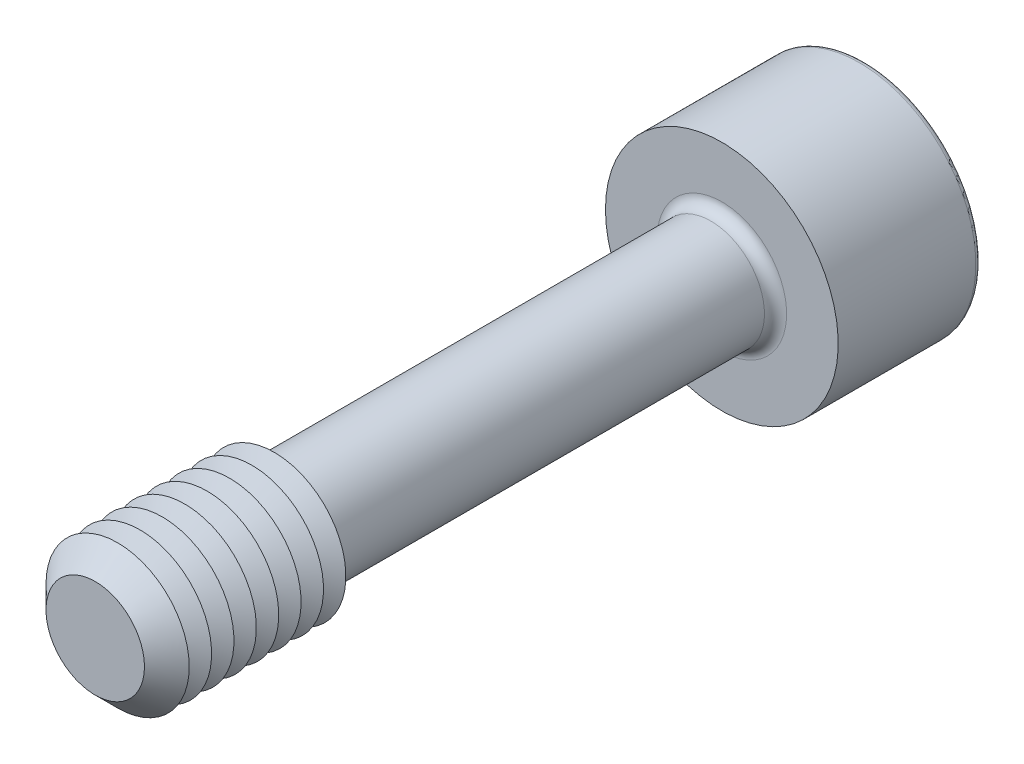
ISO-10303-21;
HEADER;
FILE_DESCRIPTION(('STEP AP214'),'2;1');
FILE_NAME('part.step','',(''),(''),'','','');
FILE_SCHEMA(('AUTOMOTIVE_DESIGN { 1 0 10303 214 1 1 1 1 }'));
ENDSEC;
DATA;
#1=APPLICATION_CONTEXT('core data for automotive mechanical design processes');
#2=APPLICATION_PROTOCOL_DEFINITION('international standard','automotive_design',2000,#1);
#3=PRODUCT_CONTEXT('',#1,'mechanical');
#4=PRODUCT('Part','Part','',(#3));
#5=PRODUCT_RELATED_PRODUCT_CATEGORY('part','',(#4));
#6=PRODUCT_DEFINITION_FORMATION('','',#4);
#7=PRODUCT_DEFINITION_CONTEXT('part definition',#1,'design');
#8=PRODUCT_DEFINITION('design','',#6,#7);
#9=PRODUCT_DEFINITION_SHAPE('','',#8);
#10=(LENGTH_UNIT() NAMED_UNIT(*) SI_UNIT(.MILLI.,.METRE.));
#11=(NAMED_UNIT(*) PLANE_ANGLE_UNIT() SI_UNIT($,.RADIAN.));
#12=(NAMED_UNIT(*) SI_UNIT($,.STERADIAN.) SOLID_ANGLE_UNIT());
#13=UNCERTAINTY_MEASURE_WITH_UNIT(LENGTH_MEASURE(1.E-05),#10,'distance_accuracy_value','');
#14=(GEOMETRIC_REPRESENTATION_CONTEXT(3) GLOBAL_UNCERTAINTY_ASSIGNED_CONTEXT((#13)) GLOBAL_UNIT_ASSIGNED_CONTEXT((#10,
#11,#12)) REPRESENTATION_CONTEXT('',''));
#15=CARTESIAN_POINT('',(0.,0.,0.));
#16=DIRECTION('',(0.,0.,1.));
#17=DIRECTION('',(1.,0.,0.));
#18=AXIS2_PLACEMENT_3D('',#15,#16,#17);
#19=CARTESIAN_POINT('',(-1.73205080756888,-3.,-19.5));
#20=DIRECTION('',(0.,0.,1.));
#21=DIRECTION('',(1.,0.,0.));
#22=AXIS2_PLACEMENT_3D('',#19,#20,#21);
#23=PLANE('',#22);
#24=DIRECTION('',(1.,0.,0.));
#25=VECTOR('',#24,1.);
#26=CARTESIAN_POINT('',(-1.73205080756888,-3.,-19.5));
#27=LINE('',#26,#25);
#28=CARTESIAN_POINT('',(0.,-3.,-19.5));
#29=VERTEX_POINT('',#28);
#30=CARTESIAN_POINT('',(1.73205080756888,-3.,-19.5));
#31=VERTEX_POINT('',#30);
#32=EDGE_CURVE('E405',#29,#31,#27,.T.);
#33=ORIENTED_EDGE('',*,*,#32,.F.);
#34=CARTESIAN_POINT('',(0.,0.,-19.5));
#35=DIRECTION('',(0.,0.,1.));
#36=DIRECTION('',(0.,-1.,0.));
#37=AXIS2_PLACEMENT_3D('',#34,#35,#36);
#38=CIRCLE('',#37,3.);
#39=CARTESIAN_POINT('',(2.59807621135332,-1.5,-19.5));
#40=VERTEX_POINT('',#39);
#41=EDGE_CURVE('E53',#29,#40,#38,.T.);
#42=ORIENTED_EDGE('',*,*,#41,.T.);
#43=DIRECTION('',(0.5,0.866025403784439,0.));
#44=VECTOR('',#43,1.);
#45=CARTESIAN_POINT('',(1.73205080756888,-3.,-19.5));
#46=LINE('',#45,#44);
#47=EDGE_CURVE('E394',#31,#40,#46,.T.);
#48=ORIENTED_EDGE('',*,*,#47,.F.);
#49=EDGE_LOOP('',(#33,#42,#48));
#50=FACE_BOUND('',#49,.T.);
#51=ADVANCED_FACE('F41',(#50),#23,.F.);
#52=CARTESIAN_POINT('',(3.46410161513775,0.,-19.5));
#53=VERTEX_POINT('',#52);
#54=EDGE_CURVE('E399',#40,#53,#46,.T.);
#55=ORIENTED_EDGE('',*,*,#54,.F.);
#56=CARTESIAN_POINT('',(2.59807621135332,1.5,-19.5));
#57=VERTEX_POINT('',#56);
#58=EDGE_CURVE('E11',#40,#57,#38,.T.);
#59=ORIENTED_EDGE('',*,*,#58,.T.);
#60=DIRECTION('',(-0.5,0.866025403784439,0.));
#61=VECTOR('',#60,1.);
#62=CARTESIAN_POINT('',(3.46410161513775,0.,-19.5));
#63=LINE('',#62,#61);
#64=EDGE_CURVE('E390',#53,#57,#63,.T.);
#65=ORIENTED_EDGE('',*,*,#64,.F.);
#66=EDGE_LOOP('',(#55,#59,#65));
#67=FACE_BOUND('',#66,.T.);
#68=ADVANCED_FACE('F133',(#67),#23,.F.);
#69=CARTESIAN_POINT('',(1.73205080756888,3.,-19.5));
#70=VERTEX_POINT('',#69);
#71=EDGE_CURVE('E389',#57,#70,#63,.T.);
#72=ORIENTED_EDGE('',*,*,#71,.F.);
#73=CARTESIAN_POINT('',(0.,3.,-19.5));
#74=VERTEX_POINT('',#73);
#75=EDGE_CURVE('E51',#57,#74,#38,.T.);
#76=ORIENTED_EDGE('',*,*,#75,.T.);
#77=DIRECTION('',(-1.,0.,0.));
#78=VECTOR('',#77,1.);
#79=CARTESIAN_POINT('',(1.73205080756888,3.,-19.5));
#80=LINE('',#79,#78);
#81=EDGE_CURVE('E177',#70,#74,#80,.T.);
#82=ORIENTED_EDGE('',*,*,#81,.F.);
#83=EDGE_LOOP('',(#72,#76,#82));
#84=FACE_BOUND('',#83,.T.);
#85=ADVANCED_FACE('F139',(#84),#23,.F.);
#86=CARTESIAN_POINT('',(-1.73205080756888,3.,-19.5));
#87=VERTEX_POINT('',#86);
#88=EDGE_CURVE('E396',#74,#87,#80,.T.);
#89=ORIENTED_EDGE('',*,*,#88,.F.);
#90=CARTESIAN_POINT('',(-2.59807621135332,1.5,-19.5));
#91=VERTEX_POINT('',#90);
#92=EDGE_CURVE('E264',#74,#91,#38,.T.);
#93=ORIENTED_EDGE('',*,*,#92,.T.);
#94=DIRECTION('',(-0.5,-0.866025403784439,0.));
#95=VECTOR('',#94,1.);
#96=CARTESIAN_POINT('',(-1.73205080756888,3.,-19.5));
#97=LINE('',#96,#95);
#98=EDGE_CURVE('E176',#87,#91,#97,.T.);
#99=ORIENTED_EDGE('',*,*,#98,.F.);
#100=EDGE_LOOP('',(#89,#93,#99));
#101=FACE_BOUND('',#100,.T.);
#102=ADVANCED_FACE('F157',(#101),#23,.F.);
#103=CARTESIAN_POINT('',(-3.46410161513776,0.,-19.5));
#104=VERTEX_POINT('',#103);
#105=EDGE_CURVE('E170',#91,#104,#97,.T.);
#106=ORIENTED_EDGE('',*,*,#105,.F.);
#107=CARTESIAN_POINT('',(-2.59807621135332,-1.5,-19.5));
#108=VERTEX_POINT('',#107);
#109=EDGE_CURVE('E172',#91,#108,#38,.T.);
#110=ORIENTED_EDGE('',*,*,#109,.T.);
#111=DIRECTION('',(0.5,-0.866025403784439,0.));
#112=VECTOR('',#111,1.);
#113=CARTESIAN_POINT('',(-3.46410161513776,0.,-19.5));
#114=LINE('',#113,#112);
#115=EDGE_CURVE('E174',#104,#108,#114,.T.);
#116=ORIENTED_EDGE('',*,*,#115,.F.);
#117=EDGE_LOOP('',(#106,#110,#116));
#118=FACE_BOUND('',#117,.T.);
#119=ADVANCED_FACE('F146',(#118),#23,.F.);
#120=CARTESIAN_POINT('',(0.,0.,-25.5));
#121=DIRECTION('',(0.,0.,-1.));
#122=DIRECTION('',(-1.,0.,0.));
#123=AXIS2_PLACEMENT_3D('',#120,#121,#122);
#124=PLANE('',#123);
#125=CARTESIAN_POINT('',(0.,0.,-25.5));
#126=DIRECTION('',(0.,0.,-1.));
#127=DIRECTION('',(-1.,0.,0.));
#128=AXIS2_PLACEMENT_3D('',#125,#126,#127);
#129=CIRCLE('',#128,6.19);
#130=CARTESIAN_POINT('',(-6.19,0.,-25.5));
#131=VERTEX_POINT('',#130);
#132=EDGE_CURVE('E250',#131,#131,#129,.T.);
#133=ORIENTED_EDGE('',*,*,#132,.T.);
#134=EDGE_LOOP('',(#133));
#135=FACE_BOUND('',#134,.T.);
#136=DIRECTION('',(-0.5,-0.866025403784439,0.));
#137=VECTOR('',#136,1.);
#138=CARTESIAN_POINT('',(-1.73205080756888,3.,-25.5));
#139=LINE('',#138,#137);
#140=CARTESIAN_POINT('',(-1.73205080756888,3.,-25.5));
#141=VERTEX_POINT('',#140);
#142=CARTESIAN_POINT('',(-3.46410161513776,0.,-25.5));
#143=VERTEX_POINT('',#142);
#144=EDGE_CURVE('E212',#141,#143,#139,.T.);
#145=ORIENTED_EDGE('',*,*,#144,.T.);
#146=DIRECTION('',(0.5,-0.866025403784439,0.));
#147=VECTOR('',#146,1.);
#148=CARTESIAN_POINT('',(-3.46410161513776,0.,-25.5));
#149=LINE('',#148,#147);
#150=CARTESIAN_POINT('',(-1.73205080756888,-3.,-25.5));
#151=VERTEX_POINT('',#150);
#152=EDGE_CURVE('E67',#143,#151,#149,.T.);
#153=ORIENTED_EDGE('',*,*,#152,.T.);
#154=DIRECTION('',(1.,0.,0.));
#155=VECTOR('',#154,1.);
#156=CARTESIAN_POINT('',(-1.73205080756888,-3.,-25.5));
#157=LINE('',#156,#155);
#158=CARTESIAN_POINT('',(1.73205080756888,-3.,-25.5));
#159=VERTEX_POINT('',#158);
#160=EDGE_CURVE('E196',#151,#159,#157,.T.);
#161=ORIENTED_EDGE('',*,*,#160,.T.);
#162=DIRECTION('',(0.5,0.866025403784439,0.));
#163=VECTOR('',#162,1.);
#164=CARTESIAN_POINT('',(1.73205080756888,-3.,-25.5));
#165=LINE('',#164,#163);
#166=CARTESIAN_POINT('',(3.46410161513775,0.,-25.5));
#167=VERTEX_POINT('',#166);
#168=EDGE_CURVE('E200',#159,#167,#165,.T.);
#169=ORIENTED_EDGE('',*,*,#168,.T.);
#170=DIRECTION('',(-0.5,0.866025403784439,0.));
#171=VECTOR('',#170,1.);
#172=CARTESIAN_POINT('',(3.46410161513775,0.,-25.5));
#173=LINE('',#172,#171);
#174=CARTESIAN_POINT('',(1.73205080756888,3.,-25.5));
#175=VERTEX_POINT('',#174);
#176=EDGE_CURVE('E204',#167,#175,#173,.T.);
#177=ORIENTED_EDGE('',*,*,#176,.T.);
#178=DIRECTION('',(-1.,0.,0.));
#179=VECTOR('',#178,1.);
#180=CARTESIAN_POINT('',(1.73205080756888,3.,-25.5));
#181=LINE('',#180,#179);
#182=EDGE_CURVE('E208',#175,#141,#181,.T.);
#183=ORIENTED_EDGE('',*,*,#182,.T.);
#184=EDGE_LOOP('',(#145,#153,#161,#169,#177,#183));
#185=FACE_BOUND('',#184,.T.);
#186=ADVANCED_FACE('F156',(#135,#185),#124,.T.);
#187=CARTESIAN_POINT('',(0.,0.,17.5));
#188=DIRECTION('',(0.,0.,-1.));
#189=DIRECTION('',(-1.,0.,0.));
#190=AXIS2_PLACEMENT_3D('',#187,#188,#189);
#191=CYLINDRICAL_SURFACE('',#190,3.);
#192=CARTESIAN_POINT('',(0.,0.,-16.88));
#193=DIRECTION('',(0.,0.,-1.));
#194=DIRECTION('',(-1.,0.,0.));
#195=AXIS2_PLACEMENT_3D('',#192,#193,#194);
#196=CIRCLE('',#195,3.);
#197=CARTESIAN_POINT('',(-3.,0.,-16.88));
#198=VERTEX_POINT('',#197);
#199=EDGE_CURVE('E247',#198,#198,#196,.F.);
#200=ORIENTED_EDGE('',*,*,#199,.T.);
#201=EDGE_LOOP('',(#200));
#202=FACE_BOUND('',#201,.T.);
#203=CARTESIAN_POINT('',(0.,0.,6.92264973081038));
#204=DIRECTION('',(0.,0.,-1.));
#205=DIRECTION('',(0.,1.,0.));
#206=AXIS2_PLACEMENT_3D('',#203,#204,#205);
#207=CIRCLE('',#206,3.);
#208=CARTESIAN_POINT('',(0.,3.,6.92264973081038));
#209=VERTEX_POINT('',#208);
#210=EDGE_CURVE('E235',#209,#209,#207,.T.);
#211=ORIENTED_EDGE('',*,*,#210,.T.);
#212=EDGE_LOOP('',(#211));
#213=FACE_BOUND('',#212,.T.);
#214=ADVANCED_FACE('F163',(#202,#213),#191,.T.);
#215=CARTESIAN_POINT('',(0.,0.,6.92264973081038));
#216=DIRECTION('',(0.,0.,1.));
#217=DIRECTION('',(0.,-1.,0.));
#218=AXIS2_PLACEMENT_3D('',#215,#216,#217);
#219=CONICAL_SURFACE('',#218,3.,1.0471975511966);
#220=CARTESIAN_POINT('',(0.,0.,7.5));
#221=DIRECTION('',(0.,0.,-1.));
#222=DIRECTION('',(-1.,0.,0.));
#223=AXIS2_PLACEMENT_3D('',#220,#221,#222);
#224=CIRCLE('',#223,4.);
#225=CARTESIAN_POINT('',(-4.,0.,7.5));
#226=VERTEX_POINT('',#225);
#227=EDGE_CURVE('E268',#226,#226,#224,.T.);
#228=ORIENTED_EDGE('',*,*,#227,.T.);
#229=EDGE_LOOP('',(#228));
#230=FACE_BOUND('',#229,.T.);
#231=ORIENTED_EDGE('',*,*,#210,.F.);
#232=EDGE_LOOP('',(#231));
#233=FACE_BOUND('',#232,.T.);
#234=ADVANCED_FACE('F347',(#230,#233),#219,.T.);
#235=CARTESIAN_POINT('',(0.,0.,-17.5));
#236=DIRECTION('',(0.,0.,-1.));
#237=DIRECTION('',(-1.,0.,0.));
#238=AXIS2_PLACEMENT_3D('',#235,#236,#237);
#239=PLANE('',#238);
#240=CARTESIAN_POINT('',(0.,0.,-17.5));
#241=DIRECTION('',(0.,0.,-1.));
#242=DIRECTION('',(-1.,0.,0.));
#243=AXIS2_PLACEMENT_3D('',#240,#241,#242);
#244=CIRCLE('',#243,3.62);
#245=CARTESIAN_POINT('',(-3.62,0.,-17.5));
#246=VERTEX_POINT('',#245);
#247=EDGE_CURVE('E243',#246,#246,#244,.T.);
#248=ORIENTED_EDGE('',*,*,#247,.T.);
#249=EDGE_LOOP('',(#248));
#250=FACE_BOUND('',#249,.T.);
#251=CARTESIAN_POINT('',(0.,0.,-17.5));
#252=DIRECTION('',(0.,0.,-1.));
#253=DIRECTION('',(-1.,0.,0.));
#254=AXIS2_PLACEMENT_3D('',#251,#252,#253);
#255=CIRCLE('',#254,6.5);
#256=CARTESIAN_POINT('',(-6.5,0.,-17.5));
#257=VERTEX_POINT('',#256);
#258=EDGE_CURVE('E231',#257,#257,#255,.T.);
#259=ORIENTED_EDGE('',*,*,#258,.F.);
#260=EDGE_LOOP('',(#259));
#261=FACE_BOUND('',#260,.T.);
#262=ADVANCED_FACE('F352',(#250,#261),#239,.F.);
#263=CARTESIAN_POINT('',(0.,0.,-25.5));
#264=DIRECTION('',(0.,0.,1.));
#265=DIRECTION('',(1.,0.,0.));
#266=AXIS2_PLACEMENT_3D('',#263,#264,#265);
#267=CYLINDRICAL_SURFACE('',#266,6.5);
#268=CARTESIAN_POINT('',(0.,0.,-25.19));
#269=DIRECTION('',(0.,0.,-1.));
#270=DIRECTION('',(-1.,0.,0.));
#271=AXIS2_PLACEMENT_3D('',#268,#269,#270);
#272=CIRCLE('',#271,6.5);
#273=CARTESIAN_POINT('',(-6.5,0.,-25.19));
#274=VERTEX_POINT('',#273);
#275=EDGE_CURVE('E45',#274,#274,#272,.F.);
#276=ORIENTED_EDGE('',*,*,#275,.T.);
#277=EDGE_LOOP('',(#276));
#278=FACE_BOUND('',#277,.T.);
#279=ORIENTED_EDGE('',*,*,#258,.T.);
#280=EDGE_LOOP('',(#279));
#281=FACE_BOUND('',#280,.T.);
#282=ADVANCED_FACE('F353',(#278,#281),#267,.T.);
#283=CARTESIAN_POINT('',(-3.46410161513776,0.,-19.5));
#284=DIRECTION('',(0.866025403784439,0.5,0.));
#285=DIRECTION('',(-0.5,0.866025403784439,0.));
#286=AXIS2_PLACEMENT_3D('',#283,#284,#285);
#287=PLANE('',#286);
#288=ORIENTED_EDGE('',*,*,#152,.F.);
#289=DIRECTION('',(0.,0.,-1.));
#290=VECTOR('',#289,1.);
#291=CARTESIAN_POINT('',(-3.46410161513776,0.,-19.5));
#292=LINE('',#291,#290);
#293=EDGE_CURVE('E186',#104,#143,#292,.T.);
#294=ORIENTED_EDGE('',*,*,#293,.F.);
#295=ORIENTED_EDGE('',*,*,#115,.T.);
#296=CARTESIAN_POINT('',(-1.73205080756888,-3.,-19.5));
#297=VERTEX_POINT('',#296);
#298=EDGE_CURVE('E215',#108,#297,#114,.T.);
#299=ORIENTED_EDGE('',*,*,#298,.T.);
#300=DIRECTION('',(0.,0.,-1.));
#301=VECTOR('',#300,1.);
#302=CARTESIAN_POINT('',(-1.73205080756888,-3.,-19.5));
#303=LINE('',#302,#301);
#304=EDGE_CURVE('E228',#297,#151,#303,.T.);
#305=ORIENTED_EDGE('',*,*,#304,.T.);
#306=EDGE_LOOP('',(#288,#294,#295,#299,#305));
#307=FACE_BOUND('',#306,.T.);
#308=ADVANCED_FACE('F356',(#307),#287,.T.);
#309=CARTESIAN_POINT('',(-1.73205080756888,-3.,-19.5));
#310=DIRECTION('',(0.,1.,0.));
#311=DIRECTION('',(0.,0.,1.));
#312=AXIS2_PLACEMENT_3D('',#309,#310,#311);
#313=PLANE('',#312);
#314=ORIENTED_EDGE('',*,*,#160,.F.);
#315=ORIENTED_EDGE('',*,*,#304,.F.);
#316=EDGE_CURVE('E402',#297,#29,#27,.T.);
#317=ORIENTED_EDGE('',*,*,#316,.T.);
#318=ORIENTED_EDGE('',*,*,#32,.T.);
#319=DIRECTION('',(0.,0.,-1.));
#320=VECTOR('',#319,1.);
#321=CARTESIAN_POINT('',(1.73205080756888,-3.,-19.5));
#322=LINE('',#321,#320);
#323=EDGE_CURVE('E225',#31,#159,#322,.T.);
#324=ORIENTED_EDGE('',*,*,#323,.T.);
#325=EDGE_LOOP('',(#314,#315,#317,#318,#324));
#326=FACE_BOUND('',#325,.T.);
#327=ADVANCED_FACE('F362',(#326),#313,.T.);
#328=CARTESIAN_POINT('',(1.73205080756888,-3.,-19.5));
#329=DIRECTION('',(-0.866025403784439,0.5,0.));
#330=DIRECTION('',(-0.5,-0.866025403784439,0.));
#331=AXIS2_PLACEMENT_3D('',#328,#329,#330);
#332=PLANE('',#331);
#333=ORIENTED_EDGE('',*,*,#168,.F.);
#334=ORIENTED_EDGE('',*,*,#323,.F.);
#335=ORIENTED_EDGE('',*,*,#47,.T.);
#336=ORIENTED_EDGE('',*,*,#54,.T.);
#337=DIRECTION('',(0.,0.,-1.));
#338=VECTOR('',#337,1.);
#339=CARTESIAN_POINT('',(3.46410161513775,0.,-19.5));
#340=LINE('',#339,#338);
#341=EDGE_CURVE('E222',#53,#167,#340,.T.);
#342=ORIENTED_EDGE('',*,*,#341,.T.);
#343=EDGE_LOOP('',(#333,#334,#335,#336,#342));
#344=FACE_BOUND('',#343,.T.);
#345=ADVANCED_FACE('F365',(#344),#332,.T.);
#346=CARTESIAN_POINT('',(3.46410161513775,0.,-19.5));
#347=DIRECTION('',(-0.866025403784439,-0.5,0.));
#348=DIRECTION('',(0.5,-0.866025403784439,0.));
#349=AXIS2_PLACEMENT_3D('',#346,#347,#348);
#350=PLANE('',#349);
#351=ORIENTED_EDGE('',*,*,#176,.F.);
#352=ORIENTED_EDGE('',*,*,#341,.F.);
#353=ORIENTED_EDGE('',*,*,#64,.T.);
#354=ORIENTED_EDGE('',*,*,#71,.T.);
#355=DIRECTION('',(0.,0.,-1.));
#356=VECTOR('',#355,1.);
#357=CARTESIAN_POINT('',(1.73205080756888,3.,-19.5));
#358=LINE('',#357,#356);
#359=EDGE_CURVE('E219',#70,#175,#358,.T.);
#360=ORIENTED_EDGE('',*,*,#359,.T.);
#361=EDGE_LOOP('',(#351,#352,#353,#354,#360));
#362=FACE_BOUND('',#361,.T.);
#363=ADVANCED_FACE('F369',(#362),#350,.T.);
#364=CARTESIAN_POINT('',(1.73205080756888,3.,-19.5));
#365=DIRECTION('',(0.,-1.,0.));
#366=DIRECTION('',(1.,0.,0.));
#367=AXIS2_PLACEMENT_3D('',#364,#365,#366);
#368=PLANE('',#367);
#369=ORIENTED_EDGE('',*,*,#182,.F.);
#370=ORIENTED_EDGE('',*,*,#359,.F.);
#371=ORIENTED_EDGE('',*,*,#81,.T.);
#372=ORIENTED_EDGE('',*,*,#88,.T.);
#373=DIRECTION('',(0.,0.,-1.));
#374=VECTOR('',#373,1.);
#375=CARTESIAN_POINT('',(-1.73205080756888,3.,-19.5));
#376=LINE('',#375,#374);
#377=EDGE_CURVE('E182',#87,#141,#376,.T.);
#378=ORIENTED_EDGE('',*,*,#377,.T.);
#379=EDGE_LOOP('',(#369,#370,#371,#372,#378));
#380=FACE_BOUND('',#379,.T.);
#381=ADVANCED_FACE('F152',(#380),#368,.T.);
#382=CARTESIAN_POINT('',(-1.73205080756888,3.,-19.5));
#383=DIRECTION('',(0.866025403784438,-0.5,0.));
#384=DIRECTION('',(0.5,0.866025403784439,0.));
#385=AXIS2_PLACEMENT_3D('',#382,#383,#384);
#386=PLANE('',#385);
#387=ORIENTED_EDGE('',*,*,#144,.F.);
#388=ORIENTED_EDGE('',*,*,#377,.F.);
#389=ORIENTED_EDGE('',*,*,#98,.T.);
#390=ORIENTED_EDGE('',*,*,#105,.T.);
#391=ORIENTED_EDGE('',*,*,#293,.T.);
#392=EDGE_LOOP('',(#387,#388,#389,#390,#391));
#393=FACE_BOUND('',#392,.T.);
#394=ADVANCED_FACE('F144',(#393),#386,.T.);
#395=ORIENTED_EDGE('',*,*,#298,.F.);
#396=EDGE_CURVE('E255',#108,#29,#38,.T.);
#397=ORIENTED_EDGE('',*,*,#396,.T.);
#398=ORIENTED_EDGE('',*,*,#316,.F.);
#399=EDGE_LOOP('',(#395,#397,#398));
#400=FACE_BOUND('',#399,.T.);
#401=ADVANCED_FACE('F135',(#400),#23,.F.);
#402=CARTESIAN_POINT('',(0.,0.,-16.88));
#403=DIRECTION('',(0.,0.,-1.));
#404=DIRECTION('',(-1.,0.,0.));
#405=AXIS2_PLACEMENT_3D('',#402,#403,#404);
#406=TOROIDAL_SURFACE('',#405,3.62,0.62);
#407=ORIENTED_EDGE('',*,*,#199,.F.);
#408=EDGE_LOOP('',(#407));
#409=FACE_BOUND('',#408,.T.);
#410=ORIENTED_EDGE('',*,*,#247,.F.);
#411=EDGE_LOOP('',(#410));
#412=FACE_BOUND('',#411,.T.);
#413=ADVANCED_FACE('F129',(#409,#412),#406,.F.);
#414=CARTESIAN_POINT('',(0.,0.,-25.19));
#415=DIRECTION('',(0.,0.,-1.));
#416=DIRECTION('',(-1.,0.,0.));
#417=AXIS2_PLACEMENT_3D('',#414,#415,#416);
#418=TOROIDAL_SURFACE('',#417,6.19,0.31);
#419=ORIENTED_EDGE('',*,*,#275,.F.);
#420=EDGE_LOOP('',(#419));
#421=FACE_BOUND('',#420,.T.);
#422=ORIENTED_EDGE('',*,*,#132,.F.);
#423=EDGE_LOOP('',(#422));
#424=FACE_BOUND('',#423,.T.);
#425=ADVANCED_FACE('F43',(#421,#424),#418,.T.);
#426=CARTESIAN_POINT('',(0.,0.,-17.7679491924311));
#427=DIRECTION('',(0.,0.,-1.));
#428=DIRECTION('',(0.,1.,0.));
#429=AXIS2_PLACEMENT_3D('',#426,#427,#428);
#430=CONICAL_SURFACE('',#429,0.,1.0471975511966);
#431=ORIENTED_EDGE('',*,*,#41,.F.);
#432=ORIENTED_EDGE('',*,*,#396,.F.);
#433=ORIENTED_EDGE('',*,*,#109,.F.);
#434=ORIENTED_EDGE('',*,*,#92,.F.);
#435=ORIENTED_EDGE('',*,*,#75,.F.);
#436=ORIENTED_EDGE('',*,*,#58,.F.);
#437=EDGE_LOOP('',(#431,#432,#433,#434,#435,#436));
#438=FACE_BOUND('',#437,.T.);
#439=CARTESIAN_POINT('',(0.,0.,-17.7679491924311));
#440=VERTEX_POINT('',#439);
#441=VERTEX_LOOP('',#440);
#442=FACE_BOUND('',#441,.T.);
#443=ADVANCED_FACE('F118',(#438,#442),#430,.F.);
#444=CARTESIAN_POINT('',(0.,0.,8.125));
#445=DIRECTION('',(0.,0.,-1.));
#446=DIRECTION('',(-1.,0.,0.));
#447=AXIS2_PLACEMENT_3D('',#444,#445,#446);
#448=CONICAL_SURFACE('',#447,2.91746824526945,1.0471975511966);
#449=ORIENTED_EDGE('',*,*,#227,.F.);
#450=EDGE_LOOP('',(#449));
#451=FACE_BOUND('',#450,.T.);
#452=CARTESIAN_POINT('',(0.,0.,8.125));
#453=DIRECTION('',(0.,0.,-1.));
#454=DIRECTION('',(-1.,0.,0.));
#455=AXIS2_PLACEMENT_3D('',#452,#453,#454);
#456=CIRCLE('',#455,2.91746824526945);
#457=CARTESIAN_POINT('',(-2.91746824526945,0.,8.125));
#458=VERTEX_POINT('',#457);
#459=EDGE_CURVE('E274',#458,#458,#456,.T.);
#460=ORIENTED_EDGE('',*,*,#459,.T.);
#461=EDGE_LOOP('',(#460));
#462=FACE_BOUND('',#461,.T.);
#463=ADVANCED_FACE('F120',(#451,#462),#448,.T.);
#464=CARTESIAN_POINT('',(0.,0.,8.75));
#465=DIRECTION('',(0.,0.,1.));
#466=DIRECTION('',(1.,0.,0.));
#467=AXIS2_PLACEMENT_3D('',#464,#465,#466);
#468=CONICAL_SURFACE('',#467,4.,1.0471975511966);
#469=ORIENTED_EDGE('',*,*,#459,.F.);
#470=EDGE_LOOP('',(#469));
#471=FACE_BOUND('',#470,.T.);
#472=CARTESIAN_POINT('',(0.,0.,8.75));
#473=DIRECTION('',(0.,0.,-1.));
#474=DIRECTION('',(-1.,0.,0.));
#475=AXIS2_PLACEMENT_3D('',#472,#473,#474);
#476=CIRCLE('',#475,4.);
#477=CARTESIAN_POINT('',(-4.,0.,8.75));
#478=VERTEX_POINT('',#477);
#479=EDGE_CURVE('E281',#478,#478,#476,.T.);
#480=ORIENTED_EDGE('',*,*,#479,.T.);
#481=EDGE_LOOP('',(#480));
#482=FACE_BOUND('',#481,.T.);
#483=ADVANCED_FACE('F126',(#471,#482),#468,.T.);
#484=CARTESIAN_POINT('',(0.,0.,9.375));
#485=DIRECTION('',(0.,0.,-1.));
#486=DIRECTION('',(-1.,0.,0.));
#487=AXIS2_PLACEMENT_3D('',#484,#485,#486);
#488=CONICAL_SURFACE('',#487,2.91746824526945,1.0471975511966);
#489=ORIENTED_EDGE('',*,*,#479,.F.);
#490=EDGE_LOOP('',(#489));
#491=FACE_BOUND('',#490,.T.);
#492=CARTESIAN_POINT('',(0.,0.,9.375));
#493=DIRECTION('',(0.,0.,-1.));
#494=DIRECTION('',(-1.,0.,0.));
#495=AXIS2_PLACEMENT_3D('',#492,#493,#494);
#496=CIRCLE('',#495,2.91746824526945);
#497=CARTESIAN_POINT('',(-2.91746824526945,0.,9.375));
#498=VERTEX_POINT('',#497);
#499=EDGE_CURVE('E287',#498,#498,#496,.T.);
#500=ORIENTED_EDGE('',*,*,#499,.T.);
#501=EDGE_LOOP('',(#500));
#502=FACE_BOUND('',#501,.T.);
#503=ADVANCED_FACE('F508',(#491,#502),#488,.T.);
#504=CARTESIAN_POINT('',(0.,0.,10.));
#505=DIRECTION('',(0.,0.,1.));
#506=DIRECTION('',(1.,0.,0.));
#507=AXIS2_PLACEMENT_3D('',#504,#505,#506);
#508=CONICAL_SURFACE('',#507,4.,1.0471975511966);
#509=ORIENTED_EDGE('',*,*,#499,.F.);
#510=EDGE_LOOP('',(#509));
#511=FACE_BOUND('',#510,.T.);
#512=CARTESIAN_POINT('',(0.,0.,10.));
#513=DIRECTION('',(0.,0.,-1.));
#514=DIRECTION('',(-1.,0.,0.));
#515=AXIS2_PLACEMENT_3D('',#512,#513,#514);
#516=CIRCLE('',#515,4.);
#517=CARTESIAN_POINT('',(-4.,0.,10.));
#518=VERTEX_POINT('',#517);
#519=EDGE_CURVE('E290',#518,#518,#516,.T.);
#520=ORIENTED_EDGE('',*,*,#519,.T.);
#521=EDGE_LOOP('',(#520));
#522=FACE_BOUND('',#521,.T.);
#523=ADVANCED_FACE('F517',(#511,#522),#508,.T.);
#524=CARTESIAN_POINT('',(0.,0.,10.625));
#525=DIRECTION('',(0.,0.,-1.));
#526=DIRECTION('',(-1.,0.,0.));
#527=AXIS2_PLACEMENT_3D('',#524,#525,#526);
#528=CONICAL_SURFACE('',#527,2.91746824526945,1.0471975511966);
#529=ORIENTED_EDGE('',*,*,#519,.F.);
#530=EDGE_LOOP('',(#529));
#531=FACE_BOUND('',#530,.T.);
#532=CARTESIAN_POINT('',(0.,0.,10.625));
#533=DIRECTION('',(0.,0.,-1.));
#534=DIRECTION('',(-1.,0.,0.));
#535=AXIS2_PLACEMENT_3D('',#532,#533,#534);
#536=CIRCLE('',#535,2.91746824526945);
#537=CARTESIAN_POINT('',(-2.91746824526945,0.,10.625));
#538=VERTEX_POINT('',#537);
#539=EDGE_CURVE('E293',#538,#538,#536,.T.);
#540=ORIENTED_EDGE('',*,*,#539,.T.);
#541=EDGE_LOOP('',(#540));
#542=FACE_BOUND('',#541,.T.);
#543=ADVANCED_FACE('F526',(#531,#542),#528,.T.);
#544=CARTESIAN_POINT('',(0.,0.,11.25));
#545=DIRECTION('',(0.,0.,1.));
#546=DIRECTION('',(1.,0.,0.));
#547=AXIS2_PLACEMENT_3D('',#544,#545,#546);
#548=CONICAL_SURFACE('',#547,4.,1.0471975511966);
#549=ORIENTED_EDGE('',*,*,#539,.F.);
#550=EDGE_LOOP('',(#549));
#551=FACE_BOUND('',#550,.T.);
#552=CARTESIAN_POINT('',(0.,0.,11.25));
#553=DIRECTION('',(0.,0.,-1.));
#554=DIRECTION('',(-1.,0.,0.));
#555=AXIS2_PLACEMENT_3D('',#552,#553,#554);
#556=CIRCLE('',#555,4.);
#557=CARTESIAN_POINT('',(-4.,0.,11.25));
#558=VERTEX_POINT('',#557);
#559=EDGE_CURVE('E297',#558,#558,#556,.T.);
#560=ORIENTED_EDGE('',*,*,#559,.T.);
#561=EDGE_LOOP('',(#560));
#562=FACE_BOUND('',#561,.T.);
#563=ADVANCED_FACE('F535',(#551,#562),#548,.T.);
#564=CARTESIAN_POINT('',(0.,0.,11.875));
#565=DIRECTION('',(0.,0.,-1.));
#566=DIRECTION('',(-1.,0.,0.));
#567=AXIS2_PLACEMENT_3D('',#564,#565,#566);
#568=CONICAL_SURFACE('',#567,2.91746824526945,1.0471975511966);
#569=ORIENTED_EDGE('',*,*,#559,.F.);
#570=EDGE_LOOP('',(#569));
#571=FACE_BOUND('',#570,.T.);
#572=CARTESIAN_POINT('',(0.,0.,11.875));
#573=DIRECTION('',(0.,0.,-1.));
#574=DIRECTION('',(-1.,0.,0.));
#575=AXIS2_PLACEMENT_3D('',#572,#573,#574);
#576=CIRCLE('',#575,2.91746824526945);
#577=CARTESIAN_POINT('',(-2.91746824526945,0.,11.875));
#578=VERTEX_POINT('',#577);
#579=EDGE_CURVE('E301',#578,#578,#576,.T.);
#580=ORIENTED_EDGE('',*,*,#579,.T.);
#581=EDGE_LOOP('',(#580));
#582=FACE_BOUND('',#581,.T.);
#583=ADVANCED_FACE('F544',(#571,#582),#568,.T.);
#584=CARTESIAN_POINT('',(0.,0.,12.5));
#585=DIRECTION('',(0.,0.,1.));
#586=DIRECTION('',(1.,0.,0.));
#587=AXIS2_PLACEMENT_3D('',#584,#585,#586);
#588=CONICAL_SURFACE('',#587,4.,1.0471975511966);
#589=ORIENTED_EDGE('',*,*,#579,.F.);
#590=EDGE_LOOP('',(#589));
#591=FACE_BOUND('',#590,.T.);
#592=CARTESIAN_POINT('',(0.,0.,12.5));
#593=DIRECTION('',(0.,0.,-1.));
#594=DIRECTION('',(-1.,0.,0.));
#595=AXIS2_PLACEMENT_3D('',#592,#593,#594);
#596=CIRCLE('',#595,4.);
#597=CARTESIAN_POINT('',(-4.,0.,12.5));
#598=VERTEX_POINT('',#597);
#599=EDGE_CURVE('E305',#598,#598,#596,.T.);
#600=ORIENTED_EDGE('',*,*,#599,.T.);
#601=EDGE_LOOP('',(#600));
#602=FACE_BOUND('',#601,.T.);
#603=ADVANCED_FACE('F553',(#591,#602),#588,.T.);
#604=CARTESIAN_POINT('',(0.,0.,13.125));
#605=DIRECTION('',(0.,0.,-1.));
#606=DIRECTION('',(-1.,0.,0.));
#607=AXIS2_PLACEMENT_3D('',#604,#605,#606);
#608=CONICAL_SURFACE('',#607,2.91746824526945,1.0471975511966);
#609=ORIENTED_EDGE('',*,*,#599,.F.);
#610=EDGE_LOOP('',(#609));
#611=FACE_BOUND('',#610,.T.);
#612=CARTESIAN_POINT('',(0.,0.,13.125));
#613=DIRECTION('',(0.,0.,-1.));
#614=DIRECTION('',(-1.,0.,0.));
#615=AXIS2_PLACEMENT_3D('',#612,#613,#614);
#616=CIRCLE('',#615,2.91746824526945);
#617=CARTESIAN_POINT('',(-2.91746824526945,0.,13.125));
#618=VERTEX_POINT('',#617);
#619=EDGE_CURVE('E309',#618,#618,#616,.T.);
#620=ORIENTED_EDGE('',*,*,#619,.T.);
#621=EDGE_LOOP('',(#620));
#622=FACE_BOUND('',#621,.T.);
#623=ADVANCED_FACE('F562',(#611,#622),#608,.T.);
#624=CARTESIAN_POINT('',(0.,0.,13.75));
#625=DIRECTION('',(0.,0.,1.));
#626=DIRECTION('',(1.,0.,0.));
#627=AXIS2_PLACEMENT_3D('',#624,#625,#626);
#628=CONICAL_SURFACE('',#627,4.,1.0471975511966);
#629=ORIENTED_EDGE('',*,*,#619,.F.);
#630=EDGE_LOOP('',(#629));
#631=FACE_BOUND('',#630,.T.);
#632=CARTESIAN_POINT('',(0.,0.,13.75));
#633=DIRECTION('',(0.,0.,-1.));
#634=DIRECTION('',(-1.,0.,0.));
#635=AXIS2_PLACEMENT_3D('',#632,#633,#634);
#636=CIRCLE('',#635,4.);
#637=CARTESIAN_POINT('',(-4.,0.,13.75));
#638=VERTEX_POINT('',#637);
#639=EDGE_CURVE('E313',#638,#638,#636,.T.);
#640=ORIENTED_EDGE('',*,*,#639,.T.);
#641=EDGE_LOOP('',(#640));
#642=FACE_BOUND('',#641,.T.);
#643=ADVANCED_FACE('F571',(#631,#642),#628,.T.);
#644=CARTESIAN_POINT('',(0.,0.,14.375));
#645=DIRECTION('',(0.,0.,-1.));
#646=DIRECTION('',(-1.,0.,0.));
#647=AXIS2_PLACEMENT_3D('',#644,#645,#646);
#648=CONICAL_SURFACE('',#647,2.91746824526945,1.0471975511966);
#649=ORIENTED_EDGE('',*,*,#639,.F.);
#650=EDGE_LOOP('',(#649));
#651=FACE_BOUND('',#650,.T.);
#652=CARTESIAN_POINT('',(0.,0.,14.375));
#653=DIRECTION('',(0.,0.,-1.));
#654=DIRECTION('',(-1.,0.,0.));
#655=AXIS2_PLACEMENT_3D('',#652,#653,#654);
#656=CIRCLE('',#655,2.91746824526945);
#657=CARTESIAN_POINT('',(-2.91746824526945,0.,14.375));
#658=VERTEX_POINT('',#657);
#659=EDGE_CURVE('E317',#658,#658,#656,.T.);
#660=ORIENTED_EDGE('',*,*,#659,.T.);
#661=EDGE_LOOP('',(#660));
#662=FACE_BOUND('',#661,.T.);
#663=ADVANCED_FACE('F580',(#651,#662),#648,.T.);
#664=CARTESIAN_POINT('',(0.,0.,15.));
#665=DIRECTION('',(0.,0.,1.));
#666=DIRECTION('',(1.,0.,0.));
#667=AXIS2_PLACEMENT_3D('',#664,#665,#666);
#668=CONICAL_SURFACE('',#667,4.,1.0471975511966);
#669=ORIENTED_EDGE('',*,*,#659,.F.);
#670=EDGE_LOOP('',(#669));
#671=FACE_BOUND('',#670,.T.);
#672=CARTESIAN_POINT('',(0.,0.,15.));
#673=DIRECTION('',(0.,0.,-1.));
#674=DIRECTION('',(-1.,0.,0.));
#675=AXIS2_PLACEMENT_3D('',#672,#673,#674);
#676=CIRCLE('',#675,4.);
#677=CARTESIAN_POINT('',(-4.,0.,15.));
#678=VERTEX_POINT('',#677);
#679=EDGE_CURVE('E321',#678,#678,#676,.T.);
#680=ORIENTED_EDGE('',*,*,#679,.T.);
#681=EDGE_LOOP('',(#680));
#682=FACE_BOUND('',#681,.T.);
#683=ADVANCED_FACE('F589',(#671,#682),#668,.T.);
#684=CARTESIAN_POINT('',(0.,0.,15.625));
#685=DIRECTION('',(0.,0.,-1.));
#686=DIRECTION('',(-1.,0.,0.));
#687=AXIS2_PLACEMENT_3D('',#684,#685,#686);
#688=CONICAL_SURFACE('',#687,2.91746824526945,1.0471975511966);
#689=ORIENTED_EDGE('',*,*,#679,.F.);
#690=EDGE_LOOP('',(#689));
#691=FACE_BOUND('',#690,.T.);
#692=CARTESIAN_POINT('',(0.,0.,15.625));
#693=DIRECTION('',(0.,0.,-1.));
#694=DIRECTION('',(-1.,0.,0.));
#695=AXIS2_PLACEMENT_3D('',#692,#693,#694);
#696=CIRCLE('',#695,2.91746824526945);
#697=CARTESIAN_POINT('',(-2.91746824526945,0.,15.625));
#698=VERTEX_POINT('',#697);
#699=EDGE_CURVE('E325',#698,#698,#696,.T.);
#700=ORIENTED_EDGE('',*,*,#699,.T.);
#701=EDGE_LOOP('',(#700));
#702=FACE_BOUND('',#701,.T.);
#703=ADVANCED_FACE('F598',(#691,#702),#688,.T.);
#704=CARTESIAN_POINT('',(0.,0.,16.25));
#705=DIRECTION('',(0.,0.,1.));
#706=DIRECTION('',(1.,0.,0.));
#707=AXIS2_PLACEMENT_3D('',#704,#705,#706);
#708=CONICAL_SURFACE('',#707,4.,1.0471975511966);
#709=ORIENTED_EDGE('',*,*,#699,.F.);
#710=EDGE_LOOP('',(#709));
#711=FACE_BOUND('',#710,.T.);
#712=CARTESIAN_POINT('',(0.,0.,16.25));
#713=DIRECTION('',(0.,0.,-1.));
#714=DIRECTION('',(-1.,0.,0.));
#715=AXIS2_PLACEMENT_3D('',#712,#713,#714);
#716=CIRCLE('',#715,4.);
#717=CARTESIAN_POINT('',(-4.,0.,16.25));
#718=VERTEX_POINT('',#717);
#719=EDGE_CURVE('E328',#718,#718,#716,.T.);
#720=ORIENTED_EDGE('',*,*,#719,.T.);
#721=EDGE_LOOP('',(#720));
#722=FACE_BOUND('',#721,.T.);
#723=ADVANCED_FACE('F332',(#711,#722),#708,.T.);
#724=CARTESIAN_POINT('',(0.,0.,17.5));
#725=DIRECTION('',(0.,0.,1.));
#726=DIRECTION('',(1.,0.,0.));
#727=AXIS2_PLACEMENT_3D('',#724,#725,#726);
#728=PLANE('',#727);
#729=CARTESIAN_POINT('',(0.,0.,17.5));
#730=DIRECTION('',(0.,0.,1.));
#731=DIRECTION('',(1.,0.,0.));
#732=AXIS2_PLACEMENT_3D('',#729,#730,#731);
#733=CIRCLE('',#732,2.75000000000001);
#734=CARTESIAN_POINT('',(2.75000000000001,0.,17.5));
#735=VERTEX_POINT('',#734);
#736=EDGE_CURVE('E239',#735,#735,#733,.T.);
#737=ORIENTED_EDGE('',*,*,#736,.T.);
#738=EDGE_LOOP('',(#737));
#739=FACE_BOUND('',#738,.T.);
#740=ADVANCED_FACE('F336',(#739),#728,.T.);
#741=CARTESIAN_POINT('',(0.,0.,16.25));
#742=DIRECTION('',(0.,0.,-1.));
#743=DIRECTION('',(0.,1.,0.));
#744=AXIS2_PLACEMENT_3D('',#741,#742,#743);
#745=CONICAL_SURFACE('',#744,4.,0.78539816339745);
#746=ORIENTED_EDGE('',*,*,#736,.F.);
#747=EDGE_LOOP('',(#746));
#748=FACE_BOUND('',#747,.T.);
#749=ORIENTED_EDGE('',*,*,#719,.F.);
#750=EDGE_LOOP('',(#749));
#751=FACE_BOUND('',#750,.T.);
#752=ADVANCED_FACE('F334',(#748,#751),#745,.T.);
#753=CLOSED_SHELL('',(#51,#68,#85,#102,#119,#186,#214,#234,#262,#282,#308,#327,#345,#363,#381,
#394,#401,#413,#425,#443,#463,#483,#503,#523,#543,#563,#583,#603,#623,#643,#663,#683,#703,#723,
#740,#752));
#754=MANIFOLD_SOLID_BREP('B2',#753);
#755=ADVANCED_BREP_SHAPE_REPRESENTATION('',(#18,#754),#14);
#756=SHAPE_DEFINITION_REPRESENTATION(#9,#755);
ENDSEC;
END-ISO-10303-21;
